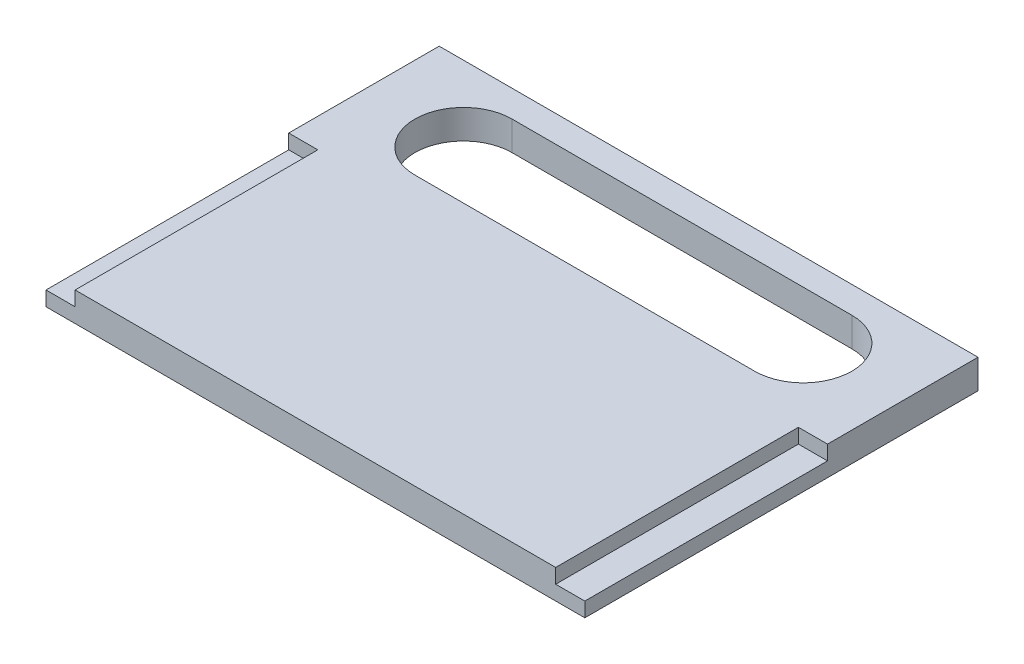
from build123d import *

# Parameters (mm, degrees)
ESQUISSE1_W             = 111
ESQUISSE1_H             = 81
BOSS_EXTRU_1_DEPTH      = 6
ESQUISSE2_W             = 6
ESQUISSE2_H             = 50
ENL_V_MAT_EXTRU_1_DEPTH = 3
ENL_V_MAT_EXTRU_2_DEPTH = 6


with BuildPart() as part:
    # Esquisse1 → Boss.-Extru.1 (new body)
    with BuildSketch(Plane(origin=(0, 0, 0), x_dir=(1, 0, 0), z_dir=(0, 1, 0))):
        Rectangle(ESQUISSE1_W, ESQUISSE1_H)
    extrude(amount=BOSS_EXTRU_1_DEPTH)

    # Esquisse2 → Enl_v. mat.-Extru.1 (cut)
    with BuildSketch(Plane(origin=(0, 6, 0), x_dir=(1, 0, 0), z_dir=(0, 1, 0))):
        with Locations((-52.5, -15.5)):
            Rectangle(ESQUISSE2_W, ESQUISSE2_H)
    enl_v_mat_extru_1 = extrude(amount=-ENL_V_MAT_EXTRU_1_DEPTH, mode=Mode.SUBTRACT)

    # Sym_trie1: Enl_v. mat.-Extru.1 across plane
    add(enl_v_mat_extru_1.mirror(Plane(origin=(0, 0, 0), x_dir=(0, 0, 1), z_dir=(1, 0, 0))), mode=Mode.SUBTRACT)

    # Esquisse3 → Enl_v. mat.-Extru.2 (cut)
    with BuildSketch(Plane(origin=(0, 6, 0), x_dir=(1, 0, 0), z_dir=(0, 1, 0))):
        with BuildLine():
            Line((-35, 35), (35, 35))
            ThreePointArc((35, 35), (45, 25), (35, 15))
            Line((35, 15), (-35, 15))
            ThreePointArc((-35, 15), (-45, 25), (-35, 35))
        make_face()
    extrude(amount=-ENL_V_MAT_EXTRU_2_DEPTH, mode=Mode.SUBTRACT)


solid = part.part
